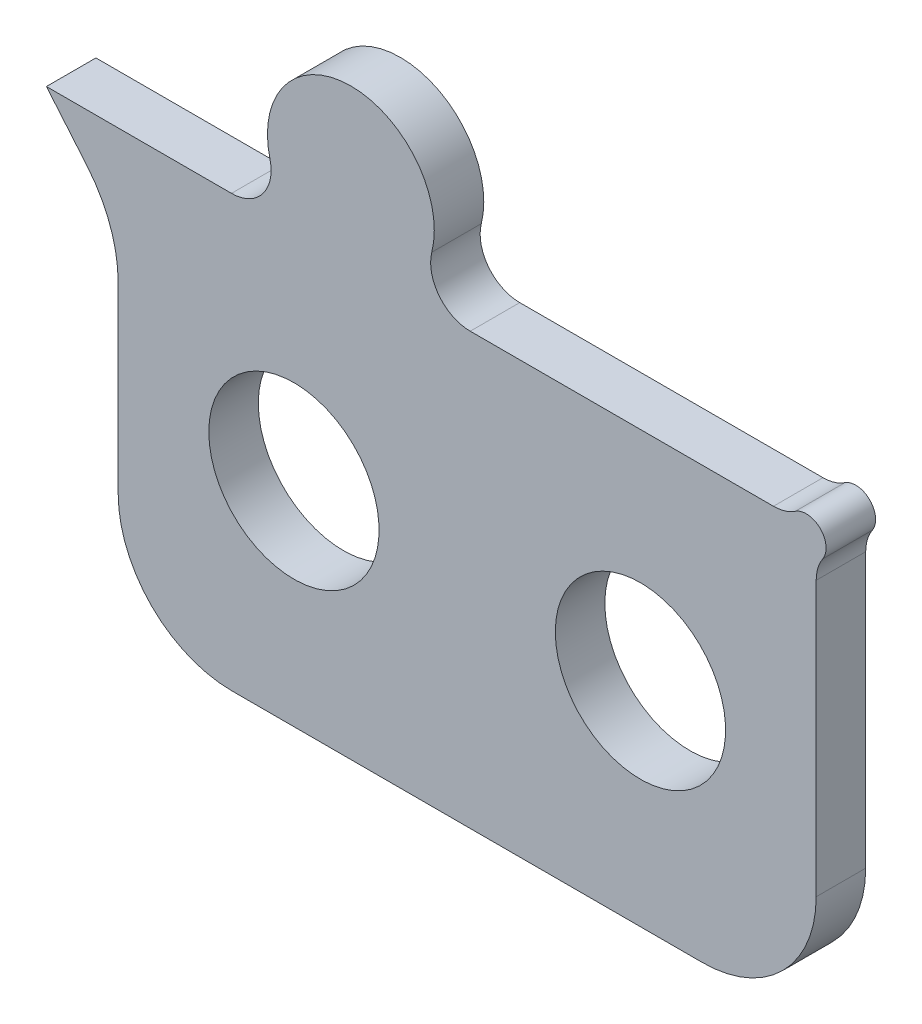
from build123d import *

# Parameters (mm, degrees)
BOSS_EXTRUDE1_DEPTH = 2.54
HOLE1_D             = 8.7376


with BuildPart() as part:
    # Sketch1 → Boss-Extrude1 (new body)
    with BuildSketch(Plane.XY):
        with BuildLine():
            Line((-121.826845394, -81.915), (-137.384846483, -81.915))
            ThreePointArc((-137.384846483, -81.915), (-138.985779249, -81.134414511), (-139.356726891, -79.392376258))
            ThreePointArc((-139.356726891, -79.392376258), (-143.51, -74.0791), (-147.663273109, -79.392376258))
            ThreePointArc((-147.663273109, -79.392376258), (-148.034220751, -81.134414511), (-149.635153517, -81.915))
            Line((-149.635153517, -81.915), (-159.131, -81.915))
            Line((-159.131, -81.915), (-157.052467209, -84.392098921))
            ThreePointArc((-157.052467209, -84.392098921), (-155.861588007, -86.454762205), (-155.448, -88.800336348))
            Line((-155.448, -88.800336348), (-155.448, -98.171))
            ThreePointArc((-155.448, -98.171), (-153.736917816, -102.301917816), (-149.606, -104.013))
            Line((-149.606, -104.013), (-125.476, -104.013))
            ThreePointArc((-125.476, -104.013), (-121.345082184, -102.301917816), (-119.634, -98.171))
            Line((-119.634, -98.171), (-119.634, -84.107845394))
            ThreePointArc((-119.634, -84.107845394), (-119.547491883, -83.52125752), (-119.295333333, -82.984615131))
            ThreePointArc((-119.295333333, -82.984615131), (-119.42357951, -81.70457951), (-120.703615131, -81.576333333))
            ThreePointArc((-120.703615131, -81.576333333), (-121.24025752, -81.828491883), (-121.826845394, -81.915))
        make_face()
    extrude(amount=BOSS_EXTRUDE1_DEPTH)

    # Hole1 (through all)
    with Locations(Plane(origin=(-143.411739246, -85.029859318, 0), x_dir=(-1, 0, 0), z_dir=(0, 0, -1))):
        with Locations((3.019260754, -8.061140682), (-14.760739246, -8.061140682)):
            Hole(HOLE1_D / 2)


solid = part.part
